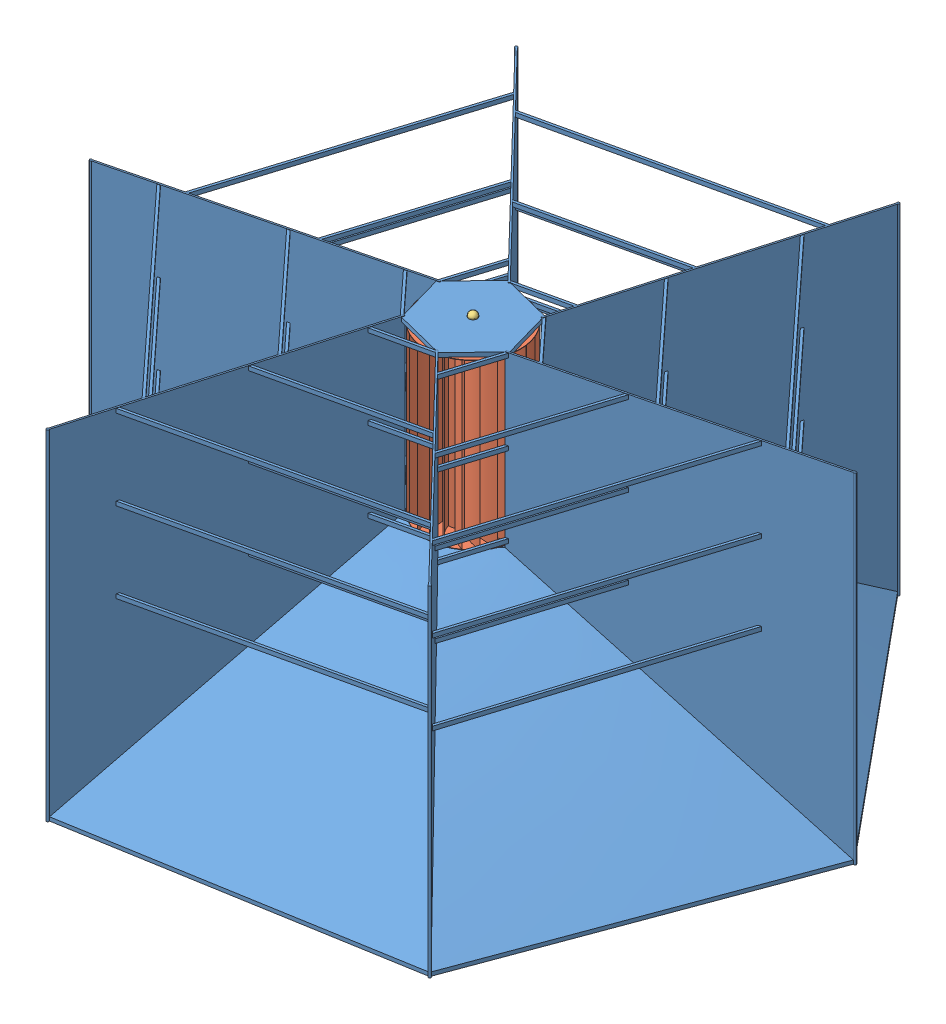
SolidWorks assembly Новый 0.SLDASM, configuration Default (file format 7000). Lengths in mm.
Overall size (7950.93 4175.12 7567.14).
5 component instances, 4 part files, 9 mates.
Components (placement in the parent):
- Новый 2-1: Новый 2.SLDPRT [Default] at (855.1898 4391.5587 6790.3426) size (7950.93 4119.39 7567.14)
- Новый 1-1: Новый 1.SLDPRT [Default] at (876.1119 5338.8296 6637.0166) x (0.963441 0 0.267921) z (-0.267921 0 0.963441) size (1150 2000 1150)
- Новый 3-1: Новый 3.SLDPRT [Default] at (1427.4698 4338.8296 6790.3426) x (-0.713747 0 0.700404) z (-0.700404 0 -0.713747) size (300 2515.73 300)
- Новый 4-5: Новый 4.SLDPRT [Default] at (1427.4698 4320.8296 6790.3426) size (200 30 200)
- Новый 4-6: Новый 4.SLDPRT [Default] at (1427.4698 6356.5587 6790.3426) size (200 30 200)
Mates (geometry in assembly coordinates):
- Coincident1: coincident: plane of Новый 2-1 through (1563.0554 4335.8296 7363.8126) normal (0 1 0); plane of Новый 3-1 through (1427.4698 4335.8296 6790.3426) normal (0 -1 0)
- Coincident4: coincident: plane of Новый 1-1 through (1034.6447 4338.8296 6600.7878) normal (0 -1 0); plane of Новый 3-1 through (1427.4698 4338.8296 6790.3426) normal (0 1 0)
- Coincident9: coincident: circle of Новый 2-1; circle of Новый 4-5
- Coincident10: coincident: plane of Новый 2-1 through (1563.0554 4335.8296 7363.8126) normal (0 1 0); plane of Новый 4-5 through (1427.4698 4335.8296 6790.3426) normal (0 1 0)
- Concentric5: concentric: circle of Новый 3-1; circle of Новый 4-5
- Coincident13: coincident: plane of Новый 2-1 through (1427.4698 6371.5587 6790.3426) normal (0 -1 0); plane of Новый 4-6 through (1427.4698 6371.5587 6790.3426) normal (0 1 0)
- Concentric6: concentric: circle of Новый 3-1; circle of Новый 4-6
- Concentric8: concentric: circle of Новый 1-1; cylinder of Новый 3-1 through (1427.4698 6338.8296 6790.3426) axis (0 -1 0) radius 50
- Concentric9: concentric: circle of Новый 1-1; circle of Новый 3-1
